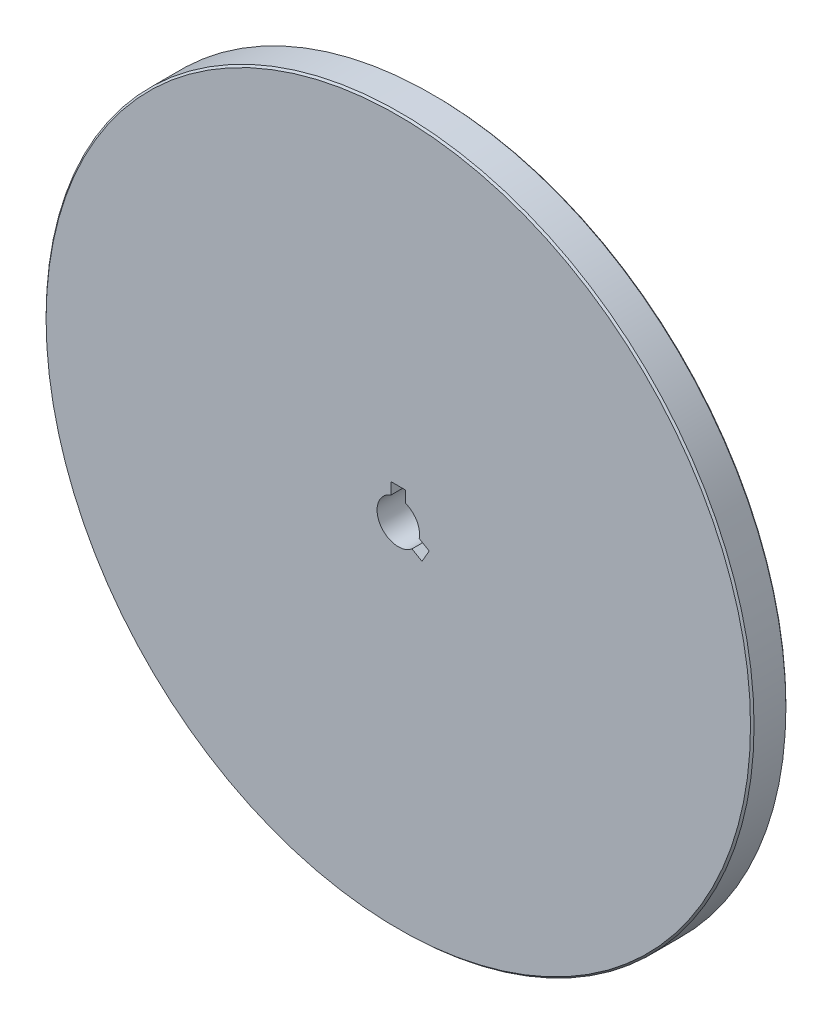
ISO-10303-21;
HEADER;
FILE_DESCRIPTION(('STEP AP214'),'2;1');
FILE_NAME('part.step','',(''),(''),'','','');
FILE_SCHEMA(('AUTOMOTIVE_DESIGN { 1 0 10303 214 1 1 1 1 }'));
ENDSEC;
DATA;
#1=APPLICATION_CONTEXT('core data for automotive mechanical design processes');
#2=APPLICATION_PROTOCOL_DEFINITION('international standard','automotive_design',2000,#1);
#3=PRODUCT_CONTEXT('',#1,'mechanical');
#4=PRODUCT('Part','Part','',(#3));
#5=PRODUCT_RELATED_PRODUCT_CATEGORY('part','',(#4));
#6=PRODUCT_DEFINITION_FORMATION('','',#4);
#7=PRODUCT_DEFINITION_CONTEXT('part definition',#1,'design');
#8=PRODUCT_DEFINITION('design','',#6,#7);
#9=PRODUCT_DEFINITION_SHAPE('','',#8);
#10=(LENGTH_UNIT() NAMED_UNIT(*) SI_UNIT(.MILLI.,.METRE.));
#11=(NAMED_UNIT(*) PLANE_ANGLE_UNIT() SI_UNIT($,.RADIAN.));
#12=(NAMED_UNIT(*) SI_UNIT($,.STERADIAN.) SOLID_ANGLE_UNIT());
#13=UNCERTAINTY_MEASURE_WITH_UNIT(LENGTH_MEASURE(1.E-05),#10,'distance_accuracy_value','');
#14=(GEOMETRIC_REPRESENTATION_CONTEXT(3) GLOBAL_UNCERTAINTY_ASSIGNED_CONTEXT((#13)) GLOBAL_UNIT_ASSIGNED_CONTEXT((#10,
#11,#12)) REPRESENTATION_CONTEXT('',''));
#15=CARTESIAN_POINT('',(0.,0.,0.));
#16=DIRECTION('',(0.,0.,1.));
#17=DIRECTION('',(1.,0.,0.));
#18=AXIS2_PLACEMENT_3D('',#15,#16,#17);
#19=CARTESIAN_POINT('',(0.,0.,10.));
#20=DIRECTION('',(0.,0.,-1.));
#21=DIRECTION('',(-1.,0.,0.));
#22=AXIS2_PLACEMENT_3D('',#19,#20,#21);
#23=CYLINDRICAL_SURFACE('',#22,6.);
#24=DIRECTION('',(0.,0.,1.));
#25=VECTOR('',#24,1.);
#26=CARTESIAN_POINT('',(5.90845420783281,-1.04411152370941,0.));
#27=LINE('',#26,#25);
#28=CARTESIAN_POINT('',(5.90845420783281,-1.04411152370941,0.));
#29=VERTEX_POINT('',#28);
#30=CARTESIAN_POINT('',(5.90845420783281,-1.04411152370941,10.));
#31=VERTEX_POINT('',#30);
#32=EDGE_CURVE('E233',#29,#31,#27,.T.);
#33=ORIENTED_EDGE('',*,*,#32,.T.);
#34=CARTESIAN_POINT('',(0.,0.,10.));
#35=DIRECTION('',(0.,0.,1.));
#36=DIRECTION('',(1.,0.,0.));
#37=AXIS2_PLACEMENT_3D('',#34,#35,#36);
#38=CIRCLE('',#37,6.);
#39=CARTESIAN_POINT('',(2.05,5.63892720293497,10.));
#40=VERTEX_POINT('',#39);
#41=EDGE_CURVE('E167',#31,#40,#38,.T.);
#42=ORIENTED_EDGE('',*,*,#41,.T.);
#43=DIRECTION('',(0.,0.,1.));
#44=VECTOR('',#43,1.);
#45=CARTESIAN_POINT('',(2.05,5.63892720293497,0.));
#46=LINE('',#45,#44);
#47=CARTESIAN_POINT('',(2.05,5.63892720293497,0.));
#48=VERTEX_POINT('',#47);
#49=EDGE_CURVE('E260',#48,#40,#46,.T.);
#50=ORIENTED_EDGE('',*,*,#49,.F.);
#51=CARTESIAN_POINT('',(0.,0.,0.));
#52=DIRECTION('',(0.,0.,1.));
#53=DIRECTION('',(1.,0.,0.));
#54=AXIS2_PLACEMENT_3D('',#51,#52,#53);
#55=CIRCLE('',#54,6.);
#56=EDGE_CURVE('E99',#29,#48,#55,.T.);
#57=ORIENTED_EDGE('',*,*,#56,.F.);
#58=EDGE_LOOP('',(#33,#42,#50,#57));
#59=FACE_BOUND('',#58,.T.);
#60=ADVANCED_FACE('F76',(#59),#23,.F.);
#61=CARTESIAN_POINT('',(0.,0.,10.));
#62=DIRECTION('',(0.,0.,1.));
#63=DIRECTION('',(1.,0.,0.));
#64=AXIS2_PLACEMENT_3D('',#61,#62,#63);
#65=PLANE('',#64);
#66=DIRECTION('',(-0.866025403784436,0.500000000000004,0.));
#67=VECTOR('',#66,1.);
#68=CARTESIAN_POINT('',(5.90845420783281,-1.04411152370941,10.));
#69=LINE('',#68,#67);
#70=CARTESIAN_POINT('',(8.73262609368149,-2.67464792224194,10.));
#71=VERTEX_POINT('',#70);
#72=EDGE_CURVE('E230',#71,#31,#69,.T.);
#73=ORIENTED_EDGE('',*,*,#72,.F.);
#74=DIRECTION('',(0.500000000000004,0.866025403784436,0.));
#75=VECTOR('',#74,1.);
#76=CARTESIAN_POINT('',(8.73262609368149,-2.67464792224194,10.));
#77=LINE('',#76,#75);
#78=CARTESIAN_POINT('',(6.68262609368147,-6.22535207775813,10.));
#79=VERTEX_POINT('',#78);
#80=EDGE_CURVE('E161',#79,#71,#77,.T.);
#81=ORIENTED_EDGE('',*,*,#80,.F.);
#82=DIRECTION('',(0.866025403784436,-0.500000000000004,0.));
#83=VECTOR('',#82,1.);
#84=CARTESIAN_POINT('',(3.85845420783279,-4.5948156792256,10.));
#85=LINE('',#84,#83);
#86=CARTESIAN_POINT('',(3.85845420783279,-4.5948156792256,10.));
#87=VERTEX_POINT('',#86);
#88=EDGE_CURVE('E144',#87,#79,#85,.T.);
#89=ORIENTED_EDGE('',*,*,#88,.F.);
#90=CARTESIAN_POINT('',(-2.05,5.63892720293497,10.));
#91=VERTEX_POINT('',#90);
#92=EDGE_CURVE('E159',#91,#87,#38,.T.);
#93=ORIENTED_EDGE('',*,*,#92,.F.);
#94=DIRECTION('',(0.,-1.,0.));
#95=VECTOR('',#94,1.);
#96=CARTESIAN_POINT('',(-2.05,5.63892720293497,10.));
#97=LINE('',#96,#95);
#98=CARTESIAN_POINT('',(-2.05,8.9,10.));
#99=VERTEX_POINT('',#98);
#100=EDGE_CURVE('E247',#99,#91,#97,.T.);
#101=ORIENTED_EDGE('',*,*,#100,.F.);
#102=DIRECTION('',(-1.,0.,0.));
#103=VECTOR('',#102,1.);
#104=CARTESIAN_POINT('',(-2.05,8.9,10.));
#105=LINE('',#104,#103);
#106=CARTESIAN_POINT('',(2.05,8.9,10.));
#107=VERTEX_POINT('',#106);
#108=EDGE_CURVE('E245',#107,#99,#105,.T.);
#109=ORIENTED_EDGE('',*,*,#108,.F.);
#110=DIRECTION('',(0.,1.,0.));
#111=VECTOR('',#110,1.);
#112=CARTESIAN_POINT('',(2.05,5.63892720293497,10.));
#113=LINE('',#112,#111);
#114=EDGE_CURVE('E239',#40,#107,#113,.T.);
#115=ORIENTED_EDGE('',*,*,#114,.F.);
#116=ORIENTED_EDGE('',*,*,#41,.F.);
#117=EDGE_LOOP('',(#73,#81,#89,#93,#101,#109,#115,#116));
#118=FACE_BOUND('',#117,.T.);
#119=CARTESIAN_POINT('',(0.,0.,10.));
#120=DIRECTION('',(0.,0.,1.));
#121=DIRECTION('',(1.,0.,0.));
#122=AXIS2_PLACEMENT_3D('',#119,#120,#121);
#123=CIRCLE('',#122,99.5);
#124=CARTESIAN_POINT('',(99.5,0.,10.));
#125=VERTEX_POINT('',#124);
#126=EDGE_CURVE('E12',#125,#125,#123,.T.);
#127=ORIENTED_EDGE('',*,*,#126,.T.);
#128=EDGE_LOOP('',(#127));
#129=FACE_BOUND('',#128,.T.);
#130=ADVANCED_FACE('F156',(#118,#129),#65,.T.);
#131=CARTESIAN_POINT('',(0.,0.,0.));
#132=DIRECTION('',(0.,0.,1.));
#133=DIRECTION('',(1.,0.,0.));
#134=AXIS2_PLACEMENT_3D('',#131,#132,#133);
#135=PLANE('',#134);
#136=CARTESIAN_POINT('',(0.,0.,0.));
#137=DIRECTION('',(0.,0.,1.));
#138=DIRECTION('',(1.,0.,0.));
#139=AXIS2_PLACEMENT_3D('',#136,#137,#138);
#140=CIRCLE('',#139,99.5);
#141=CARTESIAN_POINT('',(99.5,0.,0.));
#142=VERTEX_POINT('',#141);
#143=EDGE_CURVE('E84',#142,#142,#140,.F.);
#144=ORIENTED_EDGE('',*,*,#143,.T.);
#145=EDGE_LOOP('',(#144));
#146=FACE_BOUND('',#145,.T.);
#147=DIRECTION('',(0.500000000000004,0.866025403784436,0.));
#148=VECTOR('',#147,1.);
#149=CARTESIAN_POINT('',(8.73262609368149,-2.67464792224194,0.));
#150=LINE('',#149,#148);
#151=CARTESIAN_POINT('',(6.68262609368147,-6.22535207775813,0.));
#152=VERTEX_POINT('',#151);
#153=CARTESIAN_POINT('',(8.73262609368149,-2.67464792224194,0.));
#154=VERTEX_POINT('',#153);
#155=EDGE_CURVE('E269',#152,#154,#150,.T.);
#156=ORIENTED_EDGE('',*,*,#155,.T.);
#157=DIRECTION('',(-0.866025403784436,0.500000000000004,0.));
#158=VECTOR('',#157,1.);
#159=CARTESIAN_POINT('',(5.90845420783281,-1.04411152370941,0.));
#160=LINE('',#159,#158);
#161=EDGE_CURVE('E151',#154,#29,#160,.T.);
#162=ORIENTED_EDGE('',*,*,#161,.T.);
#163=ORIENTED_EDGE('',*,*,#56,.T.);
#164=DIRECTION('',(0.,1.,0.));
#165=VECTOR('',#164,1.);
#166=CARTESIAN_POINT('',(2.05,5.63892720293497,0.));
#167=LINE('',#166,#165);
#168=CARTESIAN_POINT('',(2.05,8.9,0.));
#169=VERTEX_POINT('',#168);
#170=EDGE_CURVE('E252',#48,#169,#167,.T.);
#171=ORIENTED_EDGE('',*,*,#170,.T.);
#172=DIRECTION('',(-1.,0.,0.));
#173=VECTOR('',#172,1.);
#174=CARTESIAN_POINT('',(-2.05,8.9,0.));
#175=LINE('',#174,#173);
#176=CARTESIAN_POINT('',(-2.05,8.9,0.));
#177=VERTEX_POINT('',#176);
#178=EDGE_CURVE('E254',#169,#177,#175,.T.);
#179=ORIENTED_EDGE('',*,*,#178,.T.);
#180=DIRECTION('',(0.,-1.,0.));
#181=VECTOR('',#180,1.);
#182=CARTESIAN_POINT('',(-2.05,5.63892720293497,0.));
#183=LINE('',#182,#181);
#184=CARTESIAN_POINT('',(-2.05,5.63892720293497,0.));
#185=VERTEX_POINT('',#184);
#186=EDGE_CURVE('E257',#177,#185,#183,.T.);
#187=ORIENTED_EDGE('',*,*,#186,.T.);
#188=CARTESIAN_POINT('',(3.85845420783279,-4.5948156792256,0.));
#189=VERTEX_POINT('',#188);
#190=EDGE_CURVE('E172',#185,#189,#55,.T.);
#191=ORIENTED_EDGE('',*,*,#190,.T.);
#192=DIRECTION('',(0.866025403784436,-0.500000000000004,0.));
#193=VECTOR('',#192,1.);
#194=CARTESIAN_POINT('',(3.85845420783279,-4.5948156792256,0.));
#195=LINE('',#194,#193);
#196=EDGE_CURVE('E91',#189,#152,#195,.T.);
#197=ORIENTED_EDGE('',*,*,#196,.T.);
#198=EDGE_LOOP('',(#156,#162,#163,#171,#179,#187,#191,#197));
#199=FACE_BOUND('',#198,.T.);
#200=ADVANCED_FACE('F180',(#146,#199),#135,.F.);
#201=CARTESIAN_POINT('',(0.,0.,10.));
#202=DIRECTION('',(0.,0.,-1.));
#203=DIRECTION('',(-1.,0.,0.));
#204=AXIS2_PLACEMENT_3D('',#201,#202,#203);
#205=CYLINDRICAL_SURFACE('',#204,100.);
#206=CARTESIAN_POINT('',(0.,0.,0.5));
#207=DIRECTION('',(0.,0.,1.));
#208=DIRECTION('',(1.,0.,0.));
#209=AXIS2_PLACEMENT_3D('',#206,#207,#208);
#210=CIRCLE('',#209,100.);
#211=CARTESIAN_POINT('',(100.,0.,0.5));
#212=VERTEX_POINT('',#211);
#213=EDGE_CURVE('E170',#212,#212,#210,.T.);
#214=ORIENTED_EDGE('',*,*,#213,.T.);
#215=EDGE_LOOP('',(#214));
#216=FACE_BOUND('',#215,.T.);
#217=CARTESIAN_POINT('',(0.,0.,9.5));
#218=DIRECTION('',(0.,0.,1.));
#219=DIRECTION('',(1.,0.,0.));
#220=AXIS2_PLACEMENT_3D('',#217,#218,#219);
#221=CIRCLE('',#220,100.);
#222=CARTESIAN_POINT('',(100.,0.,9.5));
#223=VERTEX_POINT('',#222);
#224=EDGE_CURVE('E166',#223,#223,#221,.F.);
#225=ORIENTED_EDGE('',*,*,#224,.T.);
#226=EDGE_LOOP('',(#225));
#227=FACE_BOUND('',#226,.T.);
#228=ADVANCED_FACE('F78',(#216,#227),#205,.T.);
#229=DIRECTION('',(0.,0.,1.));
#230=VECTOR('',#229,1.);
#231=CARTESIAN_POINT('',(3.85845420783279,-4.5948156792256,0.));
#232=LINE('',#231,#230);
#233=EDGE_CURVE('E141',#189,#87,#232,.T.);
#234=ORIENTED_EDGE('',*,*,#233,.F.);
#235=ORIENTED_EDGE('',*,*,#190,.F.);
#236=DIRECTION('',(0.,0.,1.));
#237=VECTOR('',#236,1.);
#238=CARTESIAN_POINT('',(-2.05,5.63892720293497,0.));
#239=LINE('',#238,#237);
#240=EDGE_CURVE('E165',#185,#91,#239,.T.);
#241=ORIENTED_EDGE('',*,*,#240,.T.);
#242=ORIENTED_EDGE('',*,*,#92,.T.);
#243=EDGE_LOOP('',(#234,#235,#241,#242));
#244=FACE_BOUND('',#243,.T.);
#245=ADVANCED_FACE('F164',(#244),#23,.F.);
#246=CARTESIAN_POINT('',(0.,0.,0.5));
#247=DIRECTION('',(0.,0.,1.));
#248=DIRECTION('',(1.,0.,0.));
#249=AXIS2_PLACEMENT_3D('',#246,#247,#248);
#250=CONICAL_SURFACE('',#249,100.,0.785398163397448);
#251=ORIENTED_EDGE('',*,*,#143,.F.);
#252=EDGE_LOOP('',(#251));
#253=FACE_BOUND('',#252,.T.);
#254=ORIENTED_EDGE('',*,*,#213,.F.);
#255=EDGE_LOOP('',(#254));
#256=FACE_BOUND('',#255,.T.);
#257=ADVANCED_FACE('F182',(#253,#256),#250,.T.);
#258=CARTESIAN_POINT('',(0.,0.,10.));
#259=DIRECTION('',(0.,0.,-1.));
#260=DIRECTION('',(-1.,0.,0.));
#261=AXIS2_PLACEMENT_3D('',#258,#259,#260);
#262=CONICAL_SURFACE('',#261,99.5,0.785398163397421);
#263=ORIENTED_EDGE('',*,*,#224,.F.);
#264=EDGE_LOOP('',(#263));
#265=FACE_BOUND('',#264,.T.);
#266=ORIENTED_EDGE('',*,*,#126,.F.);
#267=EDGE_LOOP('',(#266));
#268=FACE_BOUND('',#267,.T.);
#269=ADVANCED_FACE('F185',(#265,#268),#262,.T.);
#270=CARTESIAN_POINT('',(-2.05,5.63892720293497,0.));
#271=DIRECTION('',(-1.,0.,0.));
#272=DIRECTION('',(0.,0.,1.));
#273=AXIS2_PLACEMENT_3D('',#270,#271,#272);
#274=PLANE('',#273);
#275=ORIENTED_EDGE('',*,*,#100,.T.);
#276=ORIENTED_EDGE('',*,*,#240,.F.);
#277=ORIENTED_EDGE('',*,*,#186,.F.);
#278=DIRECTION('',(0.,0.,1.));
#279=VECTOR('',#278,1.);
#280=CARTESIAN_POINT('',(-2.05,8.9,0.));
#281=LINE('',#280,#279);
#282=EDGE_CURVE('E262',#177,#99,#281,.T.);
#283=ORIENTED_EDGE('',*,*,#282,.T.);
#284=EDGE_LOOP('',(#275,#276,#277,#283));
#285=FACE_BOUND('',#284,.T.);
#286=ADVANCED_FACE('F195',(#285),#274,.F.);
#287=CARTESIAN_POINT('',(-2.05,8.9,0.));
#288=DIRECTION('',(0.,1.,0.));
#289=DIRECTION('',(0.,0.,1.));
#290=AXIS2_PLACEMENT_3D('',#287,#288,#289);
#291=PLANE('',#290);
#292=ORIENTED_EDGE('',*,*,#108,.T.);
#293=ORIENTED_EDGE('',*,*,#282,.F.);
#294=ORIENTED_EDGE('',*,*,#178,.F.);
#295=DIRECTION('',(0.,0.,1.));
#296=VECTOR('',#295,1.);
#297=CARTESIAN_POINT('',(2.05,8.9,0.));
#298=LINE('',#297,#296);
#299=EDGE_CURVE('E264',#169,#107,#298,.T.);
#300=ORIENTED_EDGE('',*,*,#299,.T.);
#301=EDGE_LOOP('',(#292,#293,#294,#300));
#302=FACE_BOUND('',#301,.T.);
#303=ADVANCED_FACE('F212',(#302),#291,.F.);
#304=CARTESIAN_POINT('',(2.05,5.63892720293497,0.));
#305=DIRECTION('',(1.,0.,0.));
#306=DIRECTION('',(0.,0.,-1.));
#307=AXIS2_PLACEMENT_3D('',#304,#305,#306);
#308=PLANE('',#307);
#309=ORIENTED_EDGE('',*,*,#114,.T.);
#310=ORIENTED_EDGE('',*,*,#299,.F.);
#311=ORIENTED_EDGE('',*,*,#170,.F.);
#312=ORIENTED_EDGE('',*,*,#49,.T.);
#313=EDGE_LOOP('',(#309,#310,#311,#312));
#314=FACE_BOUND('',#313,.T.);
#315=ADVANCED_FACE('F208',(#314),#308,.F.);
#316=CARTESIAN_POINT('',(5.90845420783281,-1.04411152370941,0.));
#317=DIRECTION('',(0.500000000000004,0.866025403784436,0.));
#318=DIRECTION('',(-0.866025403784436,0.500000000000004,0.));
#319=AXIS2_PLACEMENT_3D('',#316,#317,#318);
#320=PLANE('',#319);
#321=ORIENTED_EDGE('',*,*,#72,.T.);
#322=ORIENTED_EDGE('',*,*,#32,.F.);
#323=ORIENTED_EDGE('',*,*,#161,.F.);
#324=DIRECTION('',(0.,0.,1.));
#325=VECTOR('',#324,1.);
#326=CARTESIAN_POINT('',(8.73262609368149,-2.67464792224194,0.));
#327=LINE('',#326,#325);
#328=EDGE_CURVE('E234',#154,#71,#327,.T.);
#329=ORIENTED_EDGE('',*,*,#328,.T.);
#330=EDGE_LOOP('',(#321,#322,#323,#329));
#331=FACE_BOUND('',#330,.T.);
#332=ADVANCED_FACE('F211',(#331),#320,.F.);
#333=CARTESIAN_POINT('',(8.73262609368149,-2.67464792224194,0.));
#334=DIRECTION('',(0.866025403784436,-0.500000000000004,0.));
#335=DIRECTION('',(0.500000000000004,0.866025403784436,0.));
#336=AXIS2_PLACEMENT_3D('',#333,#334,#335);
#337=PLANE('',#336);
#338=ORIENTED_EDGE('',*,*,#80,.T.);
#339=ORIENTED_EDGE('',*,*,#328,.F.);
#340=ORIENTED_EDGE('',*,*,#155,.F.);
#341=DIRECTION('',(0.,0.,1.));
#342=VECTOR('',#341,1.);
#343=CARTESIAN_POINT('',(6.68262609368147,-6.22535207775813,0.));
#344=LINE('',#343,#342);
#345=EDGE_CURVE('E150',#152,#79,#344,.T.);
#346=ORIENTED_EDGE('',*,*,#345,.T.);
#347=EDGE_LOOP('',(#338,#339,#340,#346));
#348=FACE_BOUND('',#347,.T.);
#349=ADVANCED_FACE('F222',(#348),#337,.F.);
#350=CARTESIAN_POINT('',(3.85845420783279,-4.5948156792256,0.));
#351=DIRECTION('',(-0.500000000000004,-0.866025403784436,0.));
#352=DIRECTION('',(0.866025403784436,-0.500000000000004,0.));
#353=AXIS2_PLACEMENT_3D('',#350,#351,#352);
#354=PLANE('',#353);
#355=ORIENTED_EDGE('',*,*,#88,.T.);
#356=ORIENTED_EDGE('',*,*,#345,.F.);
#357=ORIENTED_EDGE('',*,*,#196,.F.);
#358=ORIENTED_EDGE('',*,*,#233,.T.);
#359=EDGE_LOOP('',(#355,#356,#357,#358));
#360=FACE_BOUND('',#359,.T.);
#361=ADVANCED_FACE('F143',(#360),#354,.F.);
#362=CLOSED_SHELL('',(#60,#130,#200,#228,#245,#257,#269,#286,#303,#315,#332,#349,#361));
#363=MANIFOLD_SOLID_BREP('B2',#362);
#364=ADVANCED_BREP_SHAPE_REPRESENTATION('',(#18,#363),#14);
#365=SHAPE_DEFINITION_REPRESENTATION(#9,#364);
ENDSEC;
END-ISO-10303-21;
